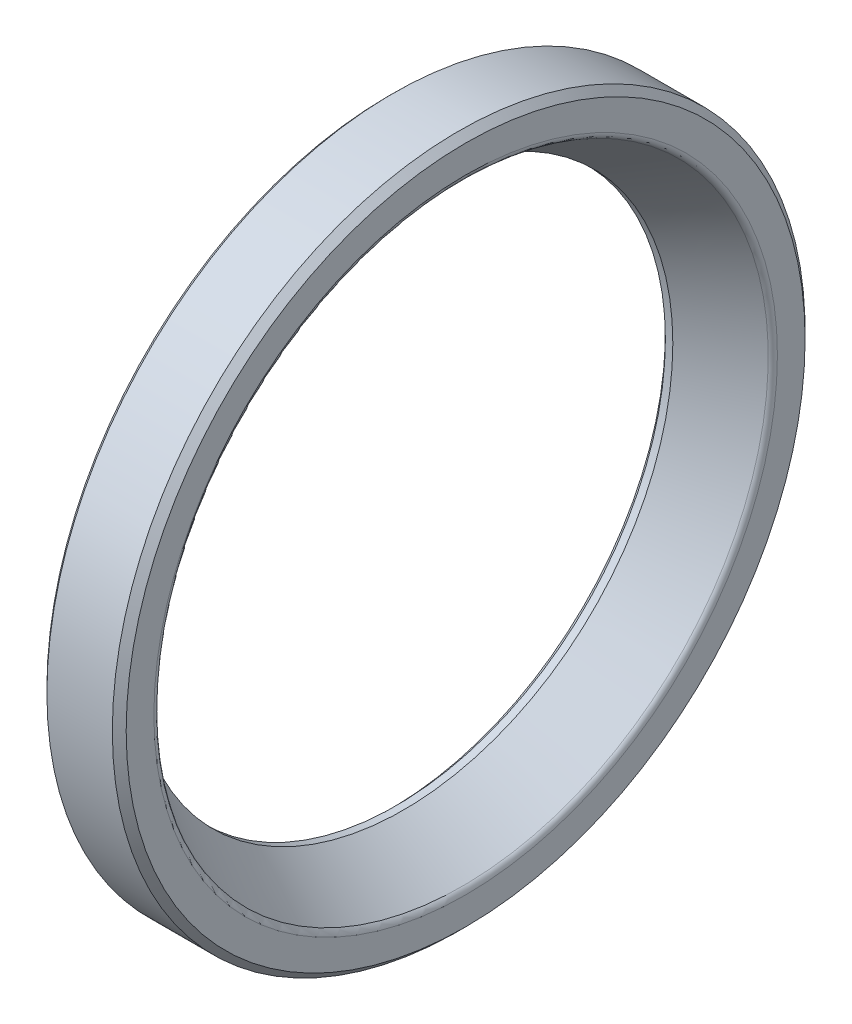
from build123d import *


with BuildPart() as part:
    # Esquisse1 → R_volution1 (revolve)
    with BuildSketch(Plane.XY, mode=Mode.PRIVATE) as r_volution1_sk:
        with BuildLine():
            Line((0, 44.4), (0, 42.872727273))
            Line((0, 42.872727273), (0.6, 42.272727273))
            Line((0.6, 42.272727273), (6.8, 42.272727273))
            ThreePointArc((6.8, 42.272727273), (6.941421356, 42.214148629), (7, 42.072727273))
            Line((7, 42.072727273), (7, 40.058994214))
            ThreePointArc((7, 40.058994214), (6.986129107, 40.008183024), (6.94836446, 39.971467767))
            Line((6.94836446, 39.971467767), (2.475683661, 37.5))
            ThreePointArc((2.475683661, 37.5), (1.916666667, 37.75), (1.357649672, 37.5))
            Line((1.357649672, 37.5), (0.25, 37.5))
            Line((0.25, 37.5), (0.25, 35.7))
            Line((0.25, 35.7), (0.95, 35))
            Line((0.95, 35), (1.916666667, 35))
            Line((1.916666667, 35), (9.573447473, 39.736153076))
            ThreePointArc((9.573447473, 39.736153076), (9.886162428, 40.063440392), (10, 40.501559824))
            Line((10, 40.501559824), (10, 44.1))
            Line((10, 44.1), (9.1, 45))
            Line((9.1, 45), (0.6, 45))
            Line((0.6, 45), (0, 44.4))
        make_face()
    revolve(r_volution1_sk.sketch.rotate(Axis((10, 0, 0), (-1, 0, 0)), 270), axis=Axis((10, 0, 0), (-1, 0, 0)))


solid = part.part
